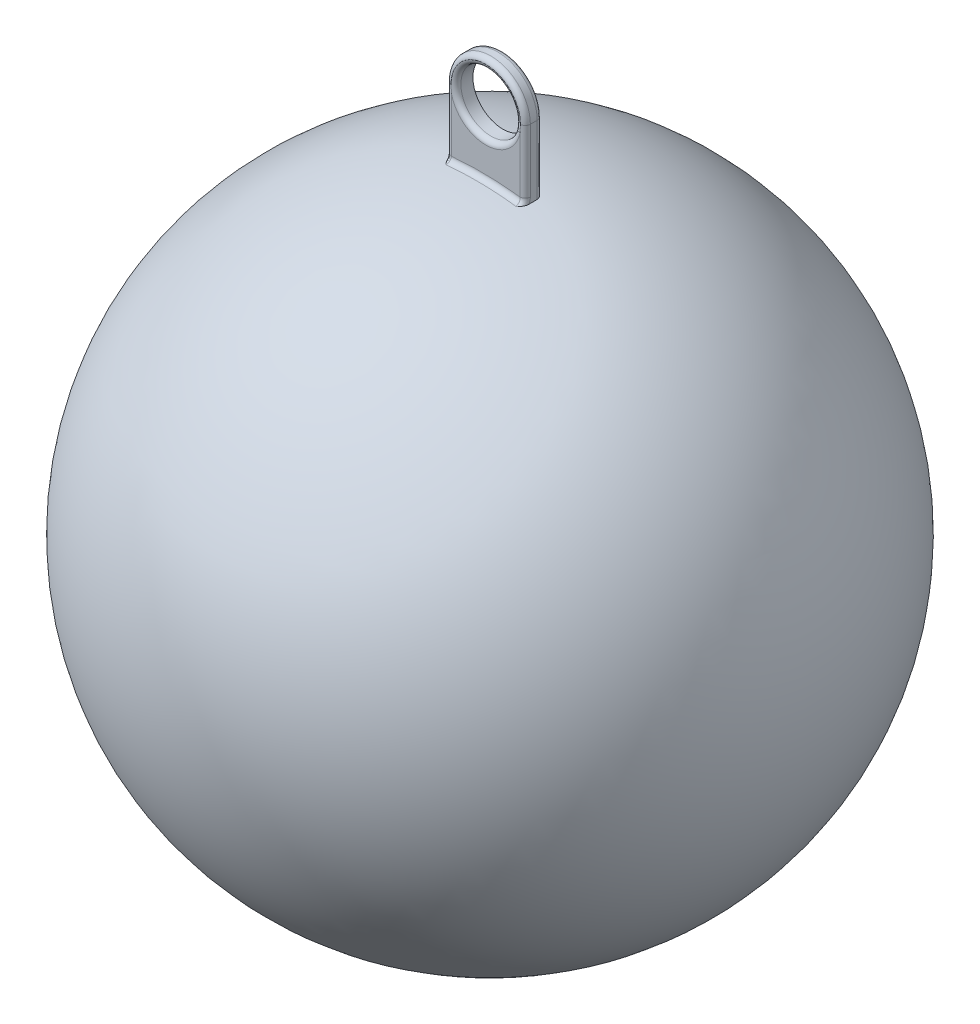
ISO-10303-21;
HEADER;
FILE_DESCRIPTION(('STEP AP214'),'2;1');
FILE_NAME('part.step','',(''),(''),'','','');
FILE_SCHEMA(('AUTOMOTIVE_DESIGN { 1 0 10303 214 1 1 1 1 }'));
ENDSEC;
DATA;
#1=APPLICATION_CONTEXT('core data for automotive mechanical design processes');
#2=APPLICATION_PROTOCOL_DEFINITION('international standard','automotive_design',2000,#1);
#3=PRODUCT_CONTEXT('',#1,'mechanical');
#4=PRODUCT('Part','Part','',(#3));
#5=PRODUCT_RELATED_PRODUCT_CATEGORY('part','',(#4));
#6=PRODUCT_DEFINITION_FORMATION('','',#4);
#7=PRODUCT_DEFINITION_CONTEXT('part definition',#1,'design');
#8=PRODUCT_DEFINITION('design','',#6,#7);
#9=PRODUCT_DEFINITION_SHAPE('','',#8);
#10=(LENGTH_UNIT() NAMED_UNIT(*) SI_UNIT(.MILLI.,.METRE.));
#11=(NAMED_UNIT(*) PLANE_ANGLE_UNIT() SI_UNIT($,.RADIAN.));
#12=(NAMED_UNIT(*) SI_UNIT($,.STERADIAN.) SOLID_ANGLE_UNIT());
#13=UNCERTAINTY_MEASURE_WITH_UNIT(LENGTH_MEASURE(1.E-05),#10,'distance_accuracy_value','');
#14=(GEOMETRIC_REPRESENTATION_CONTEXT(3) GLOBAL_UNCERTAINTY_ASSIGNED_CONTEXT((#13)) GLOBAL_UNIT_ASSIGNED_CONTEXT((#10,
#11,#12)) REPRESENTATION_CONTEXT('',''));
#15=CARTESIAN_POINT('',(0.,0.,0.));
#16=DIRECTION('',(0.,0.,1.));
#17=DIRECTION('',(1.,0.,0.));
#18=AXIS2_PLACEMENT_3D('',#15,#16,#17);
#19=CARTESIAN_POINT('',(-18.395011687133,114.330387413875,0.25));
#20=DIRECTION('',(0.,1.,0.));
#21=DIRECTION('',(0.,0.,1.));
#22=AXIS2_PLACEMENT_3D('',#19,#20,#21);
#23=PLANE('',#22);
#24=CARTESIAN_POINT('',(-17.3734946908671,114.330387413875,0.));
#25=DIRECTION('',(0.,1.,0.));
#26=DIRECTION('',(0.,0.,1.));
#27=AXIS2_PLACEMENT_3D('',#24,#25,#26);
#28=CIRCLE('',#27,1.27848300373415);
#29=CARTESIAN_POINT('',(-16.1039662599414,114.330387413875,-0.151050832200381));
#30=VERTEX_POINT('',#29);
#31=CARTESIAN_POINT('',(-16.095011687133,114.330387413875,0.));
#32=VERTEX_POINT('',#31);
#33=EDGE_CURVE('E93',#30,#32,#28,.F.);
#34=ORIENTED_EDGE('',*,*,#33,.F.);
#35=CARTESIAN_POINT('',(-16.245011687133,114.330387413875,-0.1));
#36=DIRECTION('',(0.,1.,0.));
#37=DIRECTION('',(0.,0.,1.));
#38=AXIS2_PLACEMENT_3D('',#35,#36,#37);
#39=CIRCLE('',#38,0.15);
#40=CARTESIAN_POINT('',(-16.095011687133,114.330387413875,-0.1));
#41=VERTEX_POINT('',#40);
#42=EDGE_CURVE('E162',#30,#41,#39,.F.);
#43=ORIENTED_EDGE('',*,*,#42,.T.);
#44=DIRECTION('',(0.,0.,-1.));
#45=VECTOR('',#44,1.);
#46=CARTESIAN_POINT('',(-16.095011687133,114.330387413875,0.25));
#47=LINE('',#46,#45);
#48=EDGE_CURVE('E164',#32,#41,#47,.T.);
#49=ORIENTED_EDGE('',*,*,#48,.F.);
#50=EDGE_LOOP('',(#34,#43,#49));
#51=FACE_BOUND('',#50,.T.);
#52=ADVANCED_FACE('F46',(#51),#23,.F.);
#53=CARTESIAN_POINT('',(-17.245011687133,116.330387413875,0.25));
#54=DIRECTION('',(0.,0.,1.));
#55=DIRECTION('',(1.,0.,0.));
#56=AXIS2_PLACEMENT_3D('',#53,#54,#55);
#57=PLANE('',#56);
#58=CARTESIAN_POINT('',(-17.3734946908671,105.275195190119,0.25));
#59=DIRECTION('',(0.,0.,1.));
#60=DIRECTION('',(1.,0.,0.));
#61=AXIS2_PLACEMENT_3D('',#58,#59,#60);
#62=CIRCLE('',#61,9.28638923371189);
#63=CARTESIAN_POINT('',(-18.245011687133,114.520598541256,0.25));
#64=VERTEX_POINT('',#63);
#65=CARTESIAN_POINT('',(-16.2450116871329,114.492762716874,0.25));
#66=VERTEX_POINT('',#65);
#67=EDGE_CURVE('E281',#64,#66,#62,.F.);
#68=ORIENTED_EDGE('',*,*,#67,.T.);
#69=DIRECTION('',(0.,1.,0.));
#70=VECTOR('',#69,1.);
#71=CARTESIAN_POINT('',(-16.245011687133,116.330387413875,0.25));
#72=LINE('',#71,#70);
#73=CARTESIAN_POINT('',(-16.245011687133,116.105387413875,0.25));
#74=VERTEX_POINT('',#73);
#75=EDGE_CURVE('E66',#66,#74,#72,.T.);
#76=ORIENTED_EDGE('',*,*,#75,.T.);
#77=CARTESIAN_POINT('',(-17.245011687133,116.330387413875,0.25));
#78=DIRECTION('',(0.,0.,1.));
#79=DIRECTION('',(1.,0.,0.));
#80=AXIS2_PLACEMENT_3D('',#77,#78,#79);
#81=CIRCLE('',#80,1.025);
#82=CARTESIAN_POINT('',(-18.245011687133,116.105387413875,0.25));
#83=VERTEX_POINT('',#82);
#84=EDGE_CURVE('E186',#74,#83,#81,.F.);
#85=ORIENTED_EDGE('',*,*,#84,.T.);
#86=DIRECTION('',(0.,-1.,0.));
#87=VECTOR('',#86,1.);
#88=CARTESIAN_POINT('',(-18.245011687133,114.505229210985,0.25));
#89=LINE('',#88,#87);
#90=EDGE_CURVE('E184',#83,#64,#89,.T.);
#91=ORIENTED_EDGE('',*,*,#90,.T.);
#92=EDGE_LOOP('',(#68,#76,#85,#91));
#93=FACE_BOUND('',#92,.T.);
#94=ADVANCED_FACE('F245',(#93),#57,.T.);
#95=CARTESIAN_POINT('',(-17.245011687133,116.330387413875,-0.25));
#96=DIRECTION('',(0.,0.,1.));
#97=DIRECTION('',(1.,0.,0.));
#98=AXIS2_PLACEMENT_3D('',#95,#96,#97);
#99=PLANE('',#98);
#100=CARTESIAN_POINT('',(-17.245011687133,116.330387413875,-0.25));
#101=DIRECTION('',(0.,0.,1.));
#102=DIRECTION('',(1.,0.,0.));
#103=AXIS2_PLACEMENT_3D('',#100,#101,#102);
#104=CIRCLE('',#103,1.);
#105=CARTESIAN_POINT('',(-18.245011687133,116.330387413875,-0.25));
#106=VERTEX_POINT('',#105);
#107=CARTESIAN_POINT('',(-16.245011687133,116.330387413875,-0.25));
#108=VERTEX_POINT('',#107);
#109=EDGE_CURVE('E176',#106,#108,#104,.F.);
#110=ORIENTED_EDGE('',*,*,#109,.T.);
#111=DIRECTION('',(0.,1.,0.));
#112=VECTOR('',#111,1.);
#113=CARTESIAN_POINT('',(-16.245011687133,116.330387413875,-0.25));
#114=LINE('',#113,#112);
#115=CARTESIAN_POINT('',(-16.245011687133,114.346857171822,-0.25));
#116=VERTEX_POINT('',#115);
#117=EDGE_CURVE('E172',#108,#116,#114,.F.);
#118=ORIENTED_EDGE('',*,*,#117,.T.);
#119=CARTESIAN_POINT('',(-17.3734946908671,105.275195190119,-0.25));
#120=DIRECTION('',(0.,0.,1.));
#121=DIRECTION('',(1.,0.,0.));
#122=AXIS2_PLACEMENT_3D('',#119,#120,#121);
#123=CIRCLE('',#122,9.14158219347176);
#124=CARTESIAN_POINT('',(-18.245011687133,114.375139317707,-0.25));
#125=VERTEX_POINT('',#124);
#126=EDGE_CURVE('E154',#125,#116,#123,.F.);
#127=ORIENTED_EDGE('',*,*,#126,.F.);
#128=DIRECTION('',(0.,-1.,0.));
#129=VECTOR('',#128,1.);
#130=CARTESIAN_POINT('',(-18.245011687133,116.330387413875,-0.25));
#131=LINE('',#130,#129);
#132=EDGE_CURVE('E422',#125,#106,#131,.F.);
#133=ORIENTED_EDGE('',*,*,#132,.T.);
#134=EDGE_LOOP('',(#110,#118,#127,#133));
#135=FACE_BOUND('',#134,.T.);
#136=CARTESIAN_POINT('',(-17.245011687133,116.330387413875,-0.25));
#137=DIRECTION('',(0.,0.,1.));
#138=DIRECTION('',(1.,0.,0.));
#139=AXIS2_PLACEMENT_3D('',#136,#137,#138);
#140=CIRCLE('',#139,0.875000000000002);
#141=CARTESIAN_POINT('',(-16.370011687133,116.330387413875,-0.25));
#142=VERTEX_POINT('',#141);
#143=EDGE_CURVE('E387',#142,#142,#140,.T.);
#144=ORIENTED_EDGE('',*,*,#143,.T.);
#145=EDGE_LOOP('',(#144));
#146=FACE_BOUND('',#145,.T.);
#147=ADVANCED_FACE('F251',(#135,#146),#99,.F.);
#148=CARTESIAN_POINT('',(-17.245011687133,116.330387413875,0.25));
#149=DIRECTION('',(0.,0.,-1.));
#150=DIRECTION('',(-1.,0.,0.));
#151=AXIS2_PLACEMENT_3D('',#148,#149,#150);
#152=CYLINDRICAL_SURFACE('',#151,1.15);
#153=DIRECTION('',(0.,0.,-1.));
#154=VECTOR('',#153,1.);
#155=CARTESIAN_POINT('',(-16.095011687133,116.330387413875,0.25));
#156=LINE('',#155,#154);
#157=CARTESIAN_POINT('',(-16.095011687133,116.330387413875,0.1));
#158=VERTEX_POINT('',#157);
#159=CARTESIAN_POINT('',(-16.095011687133,116.330387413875,-0.1));
#160=VERTEX_POINT('',#159);
#161=EDGE_CURVE('E273',#158,#160,#156,.T.);
#162=ORIENTED_EDGE('',*,*,#161,.T.);
#163=CARTESIAN_POINT('',(-17.245011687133,116.330387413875,-0.1));
#164=DIRECTION('',(0.,0.,1.));
#165=DIRECTION('',(1.,0.,0.));
#166=AXIS2_PLACEMENT_3D('',#163,#164,#165);
#167=CIRCLE('',#166,1.15);
#168=CARTESIAN_POINT('',(-18.395011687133,116.330387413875,-0.1));
#169=VERTEX_POINT('',#168);
#170=EDGE_CURVE('E174',#160,#169,#167,.T.);
#171=ORIENTED_EDGE('',*,*,#170,.T.);
#172=DIRECTION('',(0.,0.,-1.));
#173=VECTOR('',#172,1.);
#174=CARTESIAN_POINT('',(-18.395011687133,116.330387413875,0.25));
#175=LINE('',#174,#173);
#176=CARTESIAN_POINT('',(-18.395011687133,116.330387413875,0.1));
#177=VERTEX_POINT('',#176);
#178=EDGE_CURVE('E269',#177,#169,#175,.T.);
#179=ORIENTED_EDGE('',*,*,#178,.F.);
#180=CARTESIAN_POINT('',(-17.245011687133,116.330387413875,0.1));
#181=DIRECTION('',(0.,0.,1.));
#182=DIRECTION('',(1.,0.,0.));
#183=AXIS2_PLACEMENT_3D('',#180,#181,#182);
#184=CIRCLE('',#183,1.15);
#185=EDGE_CURVE('E171',#177,#158,#184,.F.);
#186=ORIENTED_EDGE('',*,*,#185,.T.);
#187=EDGE_LOOP('',(#162,#171,#179,#186));
#188=FACE_BOUND('',#187,.T.);
#189=ADVANCED_FACE('F214',(#188),#152,.T.);
#190=CARTESIAN_POINT('',(-18.395011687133,116.330387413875,0.25));
#191=DIRECTION('',(1.,0.,0.));
#192=DIRECTION('',(0.,0.,-1.));
#193=AXIS2_PLACEMENT_3D('',#190,#191,#192);
#194=PLANE('',#193);
#195=CARTESIAN_POINT('',(-18.395011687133,105.275195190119,0.));
#196=DIRECTION('',(1.,0.,0.));
#197=DIRECTION('',(0.,0.,-1.));
#198=AXIS2_PLACEMENT_3D('',#195,#196,#197);
#199=CIRCLE('',#198,9.08776804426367);
#200=CARTESIAN_POINT('',(-18.395011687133,114.36180594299,0.145027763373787));
#201=VERTEX_POINT('',#200);
#202=CARTESIAN_POINT('',(-18.395011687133,114.362413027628,-0.1));
#203=VERTEX_POINT('',#202);
#204=EDGE_CURVE('E278',#201,#203,#199,.F.);
#205=ORIENTED_EDGE('',*,*,#204,.F.);
#206=CARTESIAN_POINT('',(-18.395011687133,114.583752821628,0.106663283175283));
#207=CARTESIAN_POINT('',(-18.395011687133,114.551827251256,0.256254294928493));
#208=CARTESIAN_POINT('',(-18.2420810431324,114.552451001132,0.253331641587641));
#209=CARTESIAN_POINT('',(-18.395011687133,114.563055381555,0.102174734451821));
#210=CARTESIAN_POINT('',(-18.395011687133,114.541868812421,0.253091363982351));
#211=CARTESIAN_POINT('',(-18.2430343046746,114.542013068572,0.251087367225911));
#212=CARTESIAN_POINT('',(-18.395011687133,114.541840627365,0.0999714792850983));
#213=CARTESIAN_POINT('',(-18.395011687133,114.53136283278,0.250979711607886));
#214=CARTESIAN_POINT('',(-18.244019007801,114.531313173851,0.249985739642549));
#215=CARTESIAN_POINT('',(-18.395011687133,114.486636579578,0.100045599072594));
#216=CARTESIAN_POINT('',(-18.395011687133,114.503535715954,0.248447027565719));
#217=CARTESIAN_POINT('',(-18.2465987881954,114.503467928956,0.250022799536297));
#218=CARTESIAN_POINT('',(-18.395011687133,114.452604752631,0.105796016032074));
#219=CARTESIAN_POINT('',(-18.395011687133,114.48582375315,0.249738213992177));
#220=CARTESIAN_POINT('',(-18.2482062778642,114.486299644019,0.252898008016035));
#221=CARTESIAN_POINT('',(-18.395011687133,114.388404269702,0.128269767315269));
#222=CARTESIAN_POINT('',(-18.395011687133,114.451522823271,0.258606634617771));
#223=CARTESIAN_POINT('',(-18.2512703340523,114.453907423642,0.264134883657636));
#224=CARTESIAN_POINT('',(-18.395011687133,114.358235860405,0.144993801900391));
#225=CARTESIAN_POINT('',(-18.395011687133,114.434903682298,0.266127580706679));
#226=CARTESIAN_POINT('',(-18.2527268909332,114.43868361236,0.272496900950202));
#227=CARTESIAN_POINT('',(-18.395011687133,114.305206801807,0.187476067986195));
#228=CARTESIAN_POINT('',(-18.395011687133,114.405221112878,0.286784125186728));
#229=CARTESIAN_POINT('',(-18.2553072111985,114.411920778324,0.293738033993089));
#230=CARTESIAN_POINT('',(-18.395011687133,114.282332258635,0.213216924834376));
#231=CARTESIAN_POINT('',(-18.395011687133,114.392090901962,0.299885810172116));
#232=CARTESIAN_POINT('',(-18.2564316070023,114.400374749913,0.30660846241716));
#233=CARTESIAN_POINT('',(-18.395011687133,114.246539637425,0.270713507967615));
#234=CARTESIAN_POINT('',(-18.395011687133,114.371406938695,0.330017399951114));
#235=CARTESIAN_POINT('',(-18.2581989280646,114.382307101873,0.335356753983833));
#236=CARTESIAN_POINT('',(-18.395011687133,114.233578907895,0.302442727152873));
#237=CARTESIAN_POINT('',(-18.395011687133,114.363769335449,0.34705263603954));
#238=CARTESIAN_POINT('',(-18.2588439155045,114.375763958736,0.351221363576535));
#239=CARTESIAN_POINT('',(-18.395011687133,114.219016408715,0.368333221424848));
#240=CARTESIAN_POINT('',(-18.395011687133,114.355208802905,0.382710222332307));
#241=CARTESIAN_POINT('',(-18.2595689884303,114.368412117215,0.384166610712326));
#242=CARTESIAN_POINT('',(-18.395011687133,114.217367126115,0.402483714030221));
#243=CARTESIAN_POINT('',(-18.395011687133,114.35422860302,0.401382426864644));
#244=CARTESIAN_POINT('',(-18.259651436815,114.367579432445,0.401241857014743));
#245=CARTESIAN_POINT('',(-18.395011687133,114.22338875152,0.45250496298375));
#246=CARTESIAN_POINT('',(-18.395011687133,114.357772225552,0.428550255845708));
#247=CARTESIAN_POINT('',(-18.2593513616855,114.370619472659,0.426252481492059));
#248=CARTESIAN_POINT('',(-18.395011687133,114.226816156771,0.468986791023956));
#249=CARTESIAN_POINT('',(-18.395011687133,114.359794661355,0.437486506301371));
#250=CARTESIAN_POINT('',(-18.2591804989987,114.372349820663,0.434493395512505));
#251=CARTESIAN_POINT('',(-18.395011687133,114.236378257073,0.501158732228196));
#252=CARTESIAN_POINT('',(-18.395011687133,114.365403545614,0.454828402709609));
#253=CARTESIAN_POINT('',(-18.2587049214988,114.377177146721,0.450579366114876));
#254=CARTESIAN_POINT('',(-18.395011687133,114.242514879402,0.516848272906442));
#255=CARTESIAN_POINT('',(-18.395011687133,114.368995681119,0.463239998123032));
#256=CARTESIAN_POINT('',(-18.2584001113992,114.380275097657,0.458424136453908));
#257=CARTESIAN_POINT('',(-18.395011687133,114.249938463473,0.531937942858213));
#258=CARTESIAN_POINT('',(-18.395011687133,114.373313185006,0.471237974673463));
#259=CARTESIAN_POINT('',(-18.2580322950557,114.38402261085,0.465968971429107));
#260=(BOUNDED_SURFACE() B_SPLINE_SURFACE(3,2,((#206,#207,#208),(#209,#210,#211),(#212,#213,
#214),(#215,#216,#217),(#218,#219,#220),(#221,#222,#223),(#224,#225,#226),(#227,#228,#229),
(#230,#231,#232),(#233,#234,#235),(#236,#237,#238),(#239,#240,#241),(#242,#243,#244),(#245,#246,
#247),(#248,#249,#250),(#251,#252,#253),(#254,#255,#256),(#257,#258,#259)),.UNSPECIFIED.,.F.,
.F.,.F.) B_SPLINE_SURFACE_WITH_KNOTS((4,2,2,2,2,2,2,2,4),(3,3),(0.,0.0635048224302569,
0.165036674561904,0.266575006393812,0.367918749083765,0.468823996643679,0.569305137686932,
0.61960165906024,0.669934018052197),(0.,1.),
.UNSPECIFIED.) GEOMETRIC_REPRESENTATION_ITEM() RATIONAL_B_SPLINE_SURFACE(((1.,0.7001651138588,
1.),(1.,0.702435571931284,1.),(1.,0.70476753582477,1.),(1.,0.710846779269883,1.),(1.,
0.714605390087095,1.),(1.,0.721716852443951,1.),(1.,0.725069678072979,1.),(1.,0.730976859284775,
1.),(1.,0.733532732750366,1.),(1.,0.737537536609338,1.),(1.,0.738991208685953,1.),(1.,
0.740624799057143,1.),(1.,0.740810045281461,1.),(1.,0.740134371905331,1.),(1.,0.739749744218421,
1.),(1.,0.738677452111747,1.),(1.,0.737989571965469,1.),(1.,0.737158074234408,1.))) REPRESENTATION_ITEM('') SURFACE());
#261=CARTESIAN_POINT('',(-18.395011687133,114.249938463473,0.531937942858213));
#262=CARTESIAN_POINT('',(-18.395011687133,114.242514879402,0.516848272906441));
#263=CARTESIAN_POINT('',(-18.395011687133,114.236378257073,0.501158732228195));
#264=CARTESIAN_POINT('',(-18.395011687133,114.226816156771,0.468986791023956));
#265=CARTESIAN_POINT('',(-18.395011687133,114.22338875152,0.45250496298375));
#266=CARTESIAN_POINT('',(-18.395011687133,114.217367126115,0.40248371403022));
#267=CARTESIAN_POINT('',(-18.395011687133,114.219016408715,0.368333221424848));
#268=CARTESIAN_POINT('',(-18.395011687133,114.233578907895,0.302442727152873));
#269=CARTESIAN_POINT('',(-18.395011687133,114.246539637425,0.270713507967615));
#270=CARTESIAN_POINT('',(-18.395011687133,114.282332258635,0.213216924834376));
#271=CARTESIAN_POINT('',(-18.395011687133,114.305206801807,0.187476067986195));
#272=CARTESIAN_POINT('',(-18.395011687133,114.358235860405,0.144993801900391));
#273=CARTESIAN_POINT('',(-18.395011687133,114.388404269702,0.128269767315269));
#274=CARTESIAN_POINT('',(-18.395011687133,114.452604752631,0.105796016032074));
#275=CARTESIAN_POINT('',(-18.395011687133,114.486636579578,0.100045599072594));
#276=CARTESIAN_POINT('',(-18.395011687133,114.541840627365,0.0999714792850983));
#277=CARTESIAN_POINT('',(-18.395011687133,114.563055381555,0.102174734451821));
#278=CARTESIAN_POINT('',(-18.395011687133,114.583752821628,0.106663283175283));
#279=B_SPLINE_CURVE_WITH_KNOTS('',3,(#261,#262,#263,#264,#265,#266,#267,#268,#269,#270,#271,
#272,#273,#274,#275,#276,#277,#278),.UNSPECIFIED.,.F.,.F.,(4,2,2,2,2,2,2,2,4),(0.,
0.0503323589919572,0.100628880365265,0.201110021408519,0.302015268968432,0.403359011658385,
0.504897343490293,0.60642919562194,0.669934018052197),.UNSPECIFIED.);
#280=CARTESIAN_POINT('',(-18.395011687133,114.520598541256,0.1));
#281=VERTEX_POINT('',#280);
#282=EDGE_CURVE('E416',#201,#281,#279,.T.);
#283=ORIENTED_EDGE('',*,*,#282,.T.);
#284=DIRECTION('',(0.,-1.,0.));
#285=VECTOR('',#284,1.);
#286=CARTESIAN_POINT('',(-18.395011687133,116.330387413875,0.1));
#287=LINE('',#286,#285);
#288=EDGE_CURVE('E384',#281,#177,#287,.F.);
#289=ORIENTED_EDGE('',*,*,#288,.T.);
#290=ORIENTED_EDGE('',*,*,#178,.T.);
#291=DIRECTION('',(0.,-1.,0.));
#292=VECTOR('',#291,1.);
#293=CARTESIAN_POINT('',(-18.395011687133,116.330387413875,-0.1));
#294=LINE('',#293,#292);
#295=EDGE_CURVE('E413',#169,#203,#294,.T.);
#296=ORIENTED_EDGE('',*,*,#295,.T.);
#297=EDGE_LOOP('',(#205,#283,#289,#290,#296));
#298=FACE_BOUND('',#297,.T.);
#299=ADVANCED_FACE('F256',(#298),#194,.F.);
#300=CARTESIAN_POINT('',(-16.095011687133,114.330387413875,0.146957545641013));
#301=VERTEX_POINT('',#300);
#302=EDGE_CURVE('E266',#301,#32,#47,.T.);
#303=ORIENTED_EDGE('',*,*,#302,.F.);
#304=CARTESIAN_POINT('',(-16.2488129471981,114.524953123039,0.253343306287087));
#305=CARTESIAN_POINT('',(-16.095011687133,114.524140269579,0.257156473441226));
#306=CARTESIAN_POINT('',(-16.095011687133,114.556215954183,0.106686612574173));
#307=CARTESIAN_POINT('',(-16.2475764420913,114.514404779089,0.251091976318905));
#308=CARTESIAN_POINT('',(-16.095011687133,114.514218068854,0.25369935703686));
#309=CARTESIAN_POINT('',(-16.095011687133,114.53541983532,0.102183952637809));
#310=CARTESIAN_POINT('',(-16.2462992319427,114.503591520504,0.249986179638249));
#311=CARTESIAN_POINT('',(-16.095011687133,114.503656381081,0.251276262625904));
#312=CARTESIAN_POINT('',(-16.095011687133,114.51410501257,0.0999723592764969));
#313=CARTESIAN_POINT('',(-16.2429517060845,114.475437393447,0.250022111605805));
#314=CARTESIAN_POINT('',(-16.095011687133,114.475526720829,0.24798069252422));
#315=CARTESIAN_POINT('',(-16.095011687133,114.458616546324,0.100044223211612));
#316=CARTESIAN_POINT('',(-16.2408652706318,114.458072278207,0.252910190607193));
#317=CARTESIAN_POINT('',(-16.095011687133,114.457458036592,0.248832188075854));
#318=CARTESIAN_POINT('',(-16.095011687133,114.42440005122,0.105820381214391));
#319=CARTESIAN_POINT('',(-16.2368880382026,114.425303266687,0.264206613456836));
#320=CARTESIAN_POINT('',(-16.095011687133,114.422246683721,0.257116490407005));
#321=CARTESIAN_POINT('',(-16.095011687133,114.359846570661,0.128413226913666));
#322=CARTESIAN_POINT('',(-16.2349972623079,114.409899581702,0.272615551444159));
#323=CARTESIAN_POINT('',(-16.095011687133,114.405066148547,0.264473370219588));
#324=CARTESIAN_POINT('',(-16.095011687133,114.329510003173,0.1452311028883));
#325=CARTESIAN_POINT('',(-16.2316511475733,114.382846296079,0.293961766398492));
#326=CARTESIAN_POINT('',(-16.095011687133,114.374321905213,0.285124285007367));
#327=CARTESIAN_POINT('',(-16.095011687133,114.276239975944,0.187923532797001));
#328=CARTESIAN_POINT('',(-16.2301944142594,114.37118466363,0.306884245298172));
#329=CARTESIAN_POINT('',(-16.095011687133,114.360668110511,0.298366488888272));
#330=CARTESIAN_POINT('',(-16.095011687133,114.253282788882,0.213768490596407));
#331=CARTESIAN_POINT('',(-16.2279124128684,114.352995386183,0.335760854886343));
#332=CARTESIAN_POINT('',(-16.095011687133,114.339217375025,0.329042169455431));
#333=CARTESIAN_POINT('',(-16.095011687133,114.217479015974,0.271521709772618));
#334=CARTESIAN_POINT('',(-16.2270826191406,114.346430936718,0.35169219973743));
#335=CARTESIAN_POINT('',(-16.095011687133,114.331299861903,0.346472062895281));
#336=CARTESIAN_POINT('',(-16.095011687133,114.204559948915,0.303384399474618));
#337=CARTESIAN_POINT('',(-16.2263864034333,114.340927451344,0.376389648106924));
#338=CARTESIAN_POINT('',(-16.095011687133,114.324671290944,0.373763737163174));
#339=CARTESIAN_POINT('',(-16.095011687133,114.193729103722,0.352779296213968));
#340=CARTESIAN_POINT('',(-16.2262454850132,114.339814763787,0.384738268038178));
#341=CARTESIAN_POINT('',(-16.095011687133,114.323328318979,0.383036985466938));
#342=CARTESIAN_POINT('',(-16.095011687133,114.191539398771,0.369476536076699));
#343=CARTESIAN_POINT('',(-16.226145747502,114.339027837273,0.401508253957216));
#344=CARTESIAN_POINT('',(-16.095011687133,114.322376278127,0.401673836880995));
#345=CARTESIAN_POINT('',(-16.095011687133,114.189990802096,0.40301650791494));
#346=CARTESIAN_POINT('',(-16.2261870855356,114.339354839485,0.409929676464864));
#347=CARTESIAN_POINT('',(-16.095011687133,114.322767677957,0.411047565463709));
#348=CARTESIAN_POINT('',(-16.095011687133,114.190634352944,0.419859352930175));
#349=CARTESIAN_POINT('',(-16.226320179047,114.340404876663,0.418278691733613));
#350=CARTESIAN_POINT('',(-16.095011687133,114.324038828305,0.420304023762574));
#351=CARTESIAN_POINT('',(-16.095011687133,114.192700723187,0.436557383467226));
#352=(BOUNDED_SURFACE() B_SPLINE_SURFACE(3,2,((#304,#305,#306),(#307,#308,#309),(#310,#311,
#312),(#313,#314,#315),(#316,#317,#318),(#319,#320,#321),(#322,#323,#324),(#325,#326,#327),
(#328,#329,#330),(#331,#332,#333),(#334,#335,#336),(#337,#338,#339),(#340,#341,#342),(#343,#344,
#345),(#346,#347,#348),(#349,#350,#351)),.UNSPECIFIED.,.F.,.F.,
.F.) B_SPLINE_SURFACE_WITH_KNOTS((4,2,2,2,2,2,2,4),(3,3),(0.,0.0638045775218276,
0.165887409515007,0.267981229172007,0.369743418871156,0.470763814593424,0.521075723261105,
0.571431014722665),(0.,1.),
.UNSPECIFIED.) GEOMETRIC_REPRESENTATION_ITEM() RATIONAL_B_SPLINE_SURFACE(((1.,0.69808963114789,
1.),(1.,0.70104396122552,1.),(1.,0.704072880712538,1.),(1.,0.711960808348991,1.),(1.,
0.716827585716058,1.),(1.,0.726016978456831,1.),(1.,0.730339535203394,1.),(1.,0.737936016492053,
1.),(1.,0.741213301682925,1.),(1.,0.746327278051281,1.),(1.,0.748174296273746,1.),(1.,
0.749722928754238,1.),(1.,0.750036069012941,1.),(1.,0.750257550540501,1.),(1.,0.750165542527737,
1.),(1.,0.74987000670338,1.))) REPRESENTATION_ITEM('') SURFACE());
#353=CARTESIAN_POINT('',(-16.095011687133,114.330387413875,0.146957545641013));
#354=CARTESIAN_POINT('',(-16.0949993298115,114.330387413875,0.159807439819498));
#355=CARTESIAN_POINT('',(-16.0961862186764,114.330387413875,0.172601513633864));
#356=CARTESIAN_POINT('',(-16.1005285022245,114.330387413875,0.19767029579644));
#357=CARTESIAN_POINT('',(-16.1036552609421,114.330387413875,0.209949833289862));
#358=CARTESIAN_POINT('',(-16.1094435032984,114.330387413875,0.227737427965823));
#359=CARTESIAN_POINT('',(-16.1115052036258,114.330387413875,0.233454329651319));
#360=CARTESIAN_POINT('',(-16.1159641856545,114.330387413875,0.244802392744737));
#361=CARTESIAN_POINT('',(-16.1183637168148,114.330387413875,0.250432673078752));
#362=CARTESIAN_POINT('',(-16.1209042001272,114.330387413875,0.25599971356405));
#363=B_SPLINE_CURVE_WITH_KNOTS('',3,(#353,#354,#355,#356,#357,#358,#359,#360,#361,#362),
.UNSPECIFIED.,.F.,.F.,(4,2,2,2,4),(0.,0.0384167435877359,0.0762794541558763,0.094504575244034,
0.112857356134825),.UNSPECIFIED.);
#364=CARTESIAN_POINT('',(-16.1209042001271,114.330387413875,0.255999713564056));
#365=VERTEX_POINT('',#364);
#366=EDGE_CURVE('E267',#301,#365,#363,.T.);
#367=ORIENTED_EDGE('',*,*,#366,.T.);
#368=EDGE_CURVE('E165',#32,#365,#28,.F.);
#369=ORIENTED_EDGE('',*,*,#368,.F.);
#370=EDGE_LOOP('',(#303,#367,#369));
#371=FACE_BOUND('',#370,.T.);
#372=ADVANCED_FACE('F247',(#371),#23,.F.);
#373=CARTESIAN_POINT('',(-16.095011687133,114.330387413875,0.25));
#374=DIRECTION('',(-1.,0.,0.));
#375=DIRECTION('',(0.,-1.,0.));
#376=AXIS2_PLACEMENT_3D('',#373,#374,#375);
#377=PLANE('',#376);
#378=ORIENTED_EDGE('',*,*,#48,.T.);
#379=DIRECTION('',(0.,1.,0.));
#380=VECTOR('',#379,1.);
#381=CARTESIAN_POINT('',(-16.095011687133,114.330387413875,-0.1));
#382=LINE('',#381,#380);
#383=EDGE_CURVE('E170',#41,#160,#382,.T.);
#384=ORIENTED_EDGE('',*,*,#383,.T.);
#385=ORIENTED_EDGE('',*,*,#161,.F.);
#386=DIRECTION('',(0.,1.,0.));
#387=VECTOR('',#386,1.);
#388=CARTESIAN_POINT('',(-16.095011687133,114.47315725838,0.1));
#389=LINE('',#388,#387);
#390=CARTESIAN_POINT('',(-16.095011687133,114.492762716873,0.1));
#391=VERTEX_POINT('',#390);
#392=EDGE_CURVE('E286',#158,#391,#389,.F.);
#393=ORIENTED_EDGE('',*,*,#392,.T.);
#394=CARTESIAN_POINT('',(-16.095011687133,114.556215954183,0.106686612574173));
#395=CARTESIAN_POINT('',(-16.095011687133,114.53541983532,0.102183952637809));
#396=CARTESIAN_POINT('',(-16.095011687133,114.51410501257,0.0999723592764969));
#397=CARTESIAN_POINT('',(-16.095011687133,114.458616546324,0.100044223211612));
#398=CARTESIAN_POINT('',(-16.095011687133,114.42440005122,0.105820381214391));
#399=CARTESIAN_POINT('',(-16.095011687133,114.359846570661,0.128413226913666));
#400=CARTESIAN_POINT('',(-16.095011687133,114.329510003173,0.1452311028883));
#401=CARTESIAN_POINT('',(-16.095011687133,114.276239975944,0.187923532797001));
#402=CARTESIAN_POINT('',(-16.095011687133,114.253282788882,0.213768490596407));
#403=CARTESIAN_POINT('',(-16.095011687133,114.217479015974,0.271521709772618));
#404=CARTESIAN_POINT('',(-16.095011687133,114.204559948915,0.303384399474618));
#405=CARTESIAN_POINT('',(-16.095011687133,114.193729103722,0.352779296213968));
#406=CARTESIAN_POINT('',(-16.095011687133,114.191539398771,0.369476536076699));
#407=CARTESIAN_POINT('',(-16.095011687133,114.189990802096,0.40301650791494));
#408=CARTESIAN_POINT('',(-16.095011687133,114.190634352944,0.419859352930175));
#409=CARTESIAN_POINT('',(-16.095011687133,114.192700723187,0.436557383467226));
#410=B_SPLINE_CURVE_WITH_KNOTS('',3,(#394,#395,#396,#397,#398,#399,#400,#401,#402,#403,#404,
#405,#406,#407,#408,#409),.UNSPECIFIED.,.F.,.F.,(4,2,2,2,2,2,2,4),(0.,0.0638045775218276,
0.165887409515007,0.267981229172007,0.369743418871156,0.470763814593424,0.521075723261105,
0.571431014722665),.UNSPECIFIED.);
#411=EDGE_CURVE('E288',#391,#301,#410,.T.);
#412=ORIENTED_EDGE('',*,*,#411,.T.);
#413=ORIENTED_EDGE('',*,*,#302,.T.);
#414=EDGE_LOOP('',(#378,#384,#385,#393,#412,#413));
#415=FACE_BOUND('',#414,.T.);
#416=ADVANCED_FACE('F255',(#415),#377,.F.);
#417=CARTESIAN_POINT('',(-17.245011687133,116.330387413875,0.25));
#418=DIRECTION('',(0.,0.,-1.));
#419=DIRECTION('',(-1.,0.,0.));
#420=AXIS2_PLACEMENT_3D('',#417,#418,#419);
#421=CYLINDRICAL_SURFACE('',#420,0.875000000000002);
#422=CARTESIAN_POINT('',(-17.245011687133,116.330387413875,0.1));
#423=DIRECTION('',(0.,0.,1.));
#424=DIRECTION('',(1.,0.,0.));
#425=AXIS2_PLACEMENT_3D('',#422,#423,#424);
#426=CIRCLE('',#425,0.875000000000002);
#427=CARTESIAN_POINT('',(-16.370011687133,116.330387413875,0.1));
#428=VERTEX_POINT('',#427);
#429=EDGE_CURVE('E181',#428,#428,#426,.T.);
#430=ORIENTED_EDGE('',*,*,#429,.T.);
#431=EDGE_LOOP('',(#430));
#432=FACE_BOUND('',#431,.T.);
#433=ORIENTED_EDGE('',*,*,#143,.F.);
#434=EDGE_LOOP('',(#433));
#435=FACE_BOUND('',#434,.T.);
#436=ADVANCED_FACE('F213',(#432,#435),#421,.F.);
#437=CARTESIAN_POINT('',(-17.3734946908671,105.275195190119,0.));
#438=DIRECTION('',(0.,1.,0.));
#439=DIRECTION('',(1.,0.,0.));
#440=AXIS2_PLACEMENT_3D('',#437,#438,#439);
#441=SPHERICAL_SURFACE('',#440,9.145);
#442=ORIENTED_EDGE('',*,*,#368,.T.);
#443=CARTESIAN_POINT('',(-16.1209042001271,114.330387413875,0.255999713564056));
#444=CARTESIAN_POINT('',(-16.1388868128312,114.331798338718,0.293921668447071));
#445=CARTESIAN_POINT('',(-16.1636734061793,114.334021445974,0.326666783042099));
#446=CARTESIAN_POINT('',(-16.2019349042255,114.337347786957,0.368945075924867));
#447=CARTESIAN_POINT('',(-16.2131054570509,114.338308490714,0.380469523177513));
#448=CARTESIAN_POINT('',(-16.2250291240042,114.339305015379,0.392384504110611));
#449=CARTESIAN_POINT('',(-16.2256109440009,114.339353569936,0.392964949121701));
#450=CARTESIAN_POINT('',(-16.2261931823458,114.339402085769,0.393544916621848));
#451=B_SPLINE_CURVE_WITH_KNOTS('',3,(#443,#444,#445,#446,#447,#448,#449,#450),.UNSPECIFIED.,.F.,
.F.,(4,2,2,4),(0.,0.123241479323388,0.171426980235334,0.173896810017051),.UNSPECIFIED.);
#452=CARTESIAN_POINT('',(-16.2261931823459,114.339402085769,0.39354491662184));
#453=VERTEX_POINT('',#452);
#454=EDGE_CURVE('E189',#365,#453,#451,.T.);
#455=ORIENTED_EDGE('',*,*,#454,.T.);
#456=CARTESIAN_POINT('',(-17.3734946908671,105.275195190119,0.39354491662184));
#457=DIRECTION('',(0.,0.,-1.));
#458=DIRECTION('',(-1.,0.,0.));
#459=AXIS2_PLACEMENT_3D('',#456,#457,#458);
#460=CIRCLE('',#459,9.13652819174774);
#461=CARTESIAN_POINT('',(-18.2595450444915,114.368657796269,0.39354491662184));
#462=VERTEX_POINT('',#461);
#463=EDGE_CURVE('E283',#453,#462,#460,.F.);
#464=ORIENTED_EDGE('',*,*,#463,.T.);
#465=CARTESIAN_POINT('',(-18.395011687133,114.36180594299,0.145027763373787));
#466=CARTESIAN_POINT('',(-18.3950199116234,114.361600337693,0.15785937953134));
#467=CARTESIAN_POINT('',(-18.3938464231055,114.361501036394,0.170639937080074));
#468=CARTESIAN_POINT('',(-18.3894706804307,114.361485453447,0.195720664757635));
#469=CARTESIAN_POINT('',(-18.3862894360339,114.361567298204,0.208024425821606));
#470=CARTESIAN_POINT('',(-18.3766799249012,114.361941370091,0.236632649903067));
#471=CARTESIAN_POINT('',(-18.3694757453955,114.362301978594,0.252671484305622));
#472=CARTESIAN_POINT('',(-18.3526054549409,114.363227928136,0.283439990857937));
#473=CARTESIAN_POINT('',(-18.3429278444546,114.363794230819,0.29816310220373));
#474=CARTESIAN_POINT('',(-18.3111617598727,114.365681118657,0.340791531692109));
#475=CARTESIAN_POINT('',(-18.286527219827,114.367179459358,0.366722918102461));
#476=CARTESIAN_POINT('',(-18.2607129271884,114.368594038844,0.39238612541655));
#477=CARTESIAN_POINT('',(-18.2601291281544,114.368625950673,0.392965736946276));
#478=CARTESIAN_POINT('',(-18.2595450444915,114.368657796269,0.393544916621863));
#479=B_SPLINE_CURVE_WITH_KNOTS('',3,(#465,#466,#467,#468,#469,#470,#471,#472,#473,#474,#475,
#476,#477,#478),.UNSPECIFIED.,.F.,.F.,(4,2,2,2,2,2,4),(0.,0.0383665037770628,0.0763380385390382,
0.128804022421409,0.181518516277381,0.288318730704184,0.290788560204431),.UNSPECIFIED.);
#480=EDGE_CURVE('E158',#462,#201,#479,.F.);
#481=ORIENTED_EDGE('',*,*,#480,.T.);
#482=ORIENTED_EDGE('',*,*,#204,.T.);
#483=CARTESIAN_POINT('',(-18.395011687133,114.362413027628,-0.1));
#484=CARTESIAN_POINT('',(-18.395018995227,114.3623198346,-0.108404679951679));
#485=CARTESIAN_POINT('',(-18.3943057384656,114.362295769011,-0.116807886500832));
#486=CARTESIAN_POINT('',(-18.3914914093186,114.362383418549,-0.133370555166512));
#487=CARTESIAN_POINT('',(-18.3893915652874,114.36249501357,-0.141530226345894));
#488=CARTESIAN_POINT('',(-18.38385593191,114.362851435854,-0.157384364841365));
#489=CARTESIAN_POINT('',(-18.3804195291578,114.363096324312,-0.16507861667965));
#490=CARTESIAN_POINT('',(-18.3723129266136,114.363711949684,-0.179779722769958));
#491=CARTESIAN_POINT('',(-18.3676429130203,114.364082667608,-0.186786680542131));
#492=CARTESIAN_POINT('',(-18.3571950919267,114.364939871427,-0.199927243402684));
#493=CARTESIAN_POINT('',(-18.3514157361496,114.365426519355,-0.206059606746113));
#494=CARTESIAN_POINT('',(-18.3389175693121,114.366501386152,-0.217269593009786));
#495=CARTESIAN_POINT('',(-18.3321985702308,114.367089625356,-0.222347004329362));
#496=CARTESIAN_POINT('',(-18.3179837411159,114.368353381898,-0.231324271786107));
#497=CARTESIAN_POINT('',(-18.3104847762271,114.369029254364,-0.235219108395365));
#498=CARTESIAN_POINT('',(-18.2949468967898,114.370447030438,-0.241694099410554));
#499=CARTESIAN_POINT('',(-18.2869082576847,114.371188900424,-0.244274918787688));
#500=CARTESIAN_POINT('',(-18.2731896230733,114.372468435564,-0.247438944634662));
#501=CARTESIAN_POINT('',(-18.2675923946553,114.372994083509,-0.248398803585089));
#502=CARTESIAN_POINT('',(-18.2563346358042,114.374058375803,-0.249679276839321));
#503=CARTESIAN_POINT('',(-18.2506742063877,114.374597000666,-0.250000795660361));
#504=CARTESIAN_POINT('',(-18.2450116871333,114.375139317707,-0.250000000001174));
#505=B_SPLINE_CURVE_WITH_KNOTS('',3,(#483,#484,#485,#486,#487,#488,#489,#490,#491,#492,#493,
#494,#495,#496,#497,#498,#499,#500,#501,#502,#503,#504),.UNSPECIFIED.,.F.,.F.,(4,2,2,2,2,2,2,2,
2,2,4),(0.,0.0251818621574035,0.0503414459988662,0.0755125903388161,0.100679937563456,
0.125882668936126,0.151090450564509,0.176403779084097,0.201704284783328,0.218779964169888,
0.235831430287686),.UNSPECIFIED.);
#506=EDGE_CURVE('E13',#203,#125,#505,.T.);
#507=ORIENTED_EDGE('',*,*,#506,.T.);
#508=ORIENTED_EDGE('',*,*,#126,.T.);
#509=CARTESIAN_POINT('',(-16.245011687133,114.346857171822,-0.25));
#510=CARTESIAN_POINT('',(-16.2365345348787,114.345802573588,-0.250006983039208));
#511=CARTESIAN_POINT('',(-16.2280579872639,114.344755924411,-0.249281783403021));
#512=CARTESIAN_POINT('',(-16.2113454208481,114.342707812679,-0.246416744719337));
#513=CARTESIAN_POINT('',(-16.2031092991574,114.341706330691,-0.244277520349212));
#514=CARTESIAN_POINT('',(-16.1871051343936,114.339776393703,-0.238632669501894));
#515=CARTESIAN_POINT('',(-16.1793373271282,114.338847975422,-0.235126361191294));
#516=CARTESIAN_POINT('',(-16.1644987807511,114.337091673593,-0.226845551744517));
#517=CARTESIAN_POINT('',(-16.1574279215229,114.336263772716,-0.222071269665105));
#518=CARTESIAN_POINT('',(-16.1442144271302,114.334735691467,-0.211408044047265));
#519=CARTESIAN_POINT('',(-16.138068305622,114.334035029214,-0.205523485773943));
#520=CARTESIAN_POINT('',(-16.1268532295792,114.332778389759,-0.192792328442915));
#521=CARTESIAN_POINT('',(-16.1217836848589,114.332222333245,-0.185946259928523));
#522=CARTESIAN_POINT('',(-16.1146352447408,114.331459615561,-0.174353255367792));
#523=CARTESIAN_POINT('',(-16.112166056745,114.33120170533,-0.169845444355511));
#524=CARTESIAN_POINT('',(-16.1077048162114,114.330747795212,-0.160606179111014));
#525=CARTESIAN_POINT('',(-16.105711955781,114.330551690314,-0.155875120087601));
#526=CARTESIAN_POINT('',(-16.1039662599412,114.330387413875,-0.151050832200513));
#527=B_SPLINE_CURVE_WITH_KNOTS('',3,(#509,#510,#511,#512,#513,#514,#515,#516,#517,#518,#519,
#520,#521,#522,#523,#524,#525,#526),.UNSPECIFIED.,.F.,.F.,(4,2,2,2,2,2,2,2,4),(0.,
0.0255945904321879,0.0511780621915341,0.0767743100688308,0.102366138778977,0.127858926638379,
0.153337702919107,0.16875140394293,0.18413877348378),.UNSPECIFIED.);
#528=EDGE_CURVE('E57',#116,#30,#527,.T.);
#529=ORIENTED_EDGE('',*,*,#528,.T.);
#530=ORIENTED_EDGE('',*,*,#33,.T.);
#531=EDGE_LOOP('',(#442,#455,#464,#481,#482,#507,#508,#529,#530));
#532=FACE_BOUND('',#531,.T.);
#533=ADVANCED_FACE('F152',(#532),#441,.T.);
#534=CARTESIAN_POINT('',(-17.3734946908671,105.275195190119,0.4));
#535=DIRECTION('',(0.,0.,1.));
#536=DIRECTION('',(1.,0.,0.));
#537=AXIS2_PLACEMENT_3D('',#534,#535,#536);
#538=TOROIDAL_SURFACE('',#537,9.28638923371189,0.15);
#539=ORIENTED_EDGE('',*,*,#463,.F.);
#540=CARTESIAN_POINT('',(-16.226320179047,114.340404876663,0.418278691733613));
#541=CARTESIAN_POINT('',(-16.2261870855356,114.339354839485,0.409929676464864));
#542=CARTESIAN_POINT('',(-16.226145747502,114.339027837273,0.401508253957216));
#543=CARTESIAN_POINT('',(-16.2262454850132,114.339814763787,0.384738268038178));
#544=CARTESIAN_POINT('',(-16.2263864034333,114.340927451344,0.376389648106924));
#545=CARTESIAN_POINT('',(-16.2270826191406,114.346430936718,0.35169219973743));
#546=CARTESIAN_POINT('',(-16.2279124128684,114.352995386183,0.335760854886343));
#547=CARTESIAN_POINT('',(-16.2301944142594,114.37118466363,0.306884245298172));
#548=CARTESIAN_POINT('',(-16.2316511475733,114.382846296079,0.293961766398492));
#549=CARTESIAN_POINT('',(-16.2349972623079,114.409899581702,0.272615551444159));
#550=CARTESIAN_POINT('',(-16.2368880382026,114.425303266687,0.264206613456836));
#551=CARTESIAN_POINT('',(-16.2408652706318,114.458072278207,0.252910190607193));
#552=CARTESIAN_POINT('',(-16.2429517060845,114.475437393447,0.250022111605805));
#553=CARTESIAN_POINT('',(-16.2462992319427,114.503591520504,0.249986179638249));
#554=CARTESIAN_POINT('',(-16.2475764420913,114.514404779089,0.251091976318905));
#555=CARTESIAN_POINT('',(-16.2488129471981,114.524953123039,0.253343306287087));
#556=B_SPLINE_CURVE_WITH_KNOTS('',3,(#540,#541,#542,#543,#544,#545,#546,#547,#548,#549,#550,
#551,#552,#553,#554,#555),.UNSPECIFIED.,.F.,.F.,(4,2,2,2,2,2,2,4),(0.,0.0503552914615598,
0.100667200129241,0.201687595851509,0.303449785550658,0.405543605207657,0.507626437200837,
0.571431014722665),.UNSPECIFIED.);
#557=EDGE_CURVE('E398',#453,#66,#556,.T.);
#558=ORIENTED_EDGE('',*,*,#557,.T.);
#559=ORIENTED_EDGE('',*,*,#67,.F.);
#560=CARTESIAN_POINT('',(-18.2420810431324,114.552451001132,0.253331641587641));
#561=CARTESIAN_POINT('',(-18.2430343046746,114.542013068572,0.251087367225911));
#562=CARTESIAN_POINT('',(-18.244019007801,114.531313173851,0.249985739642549));
#563=CARTESIAN_POINT('',(-18.2465987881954,114.503467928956,0.250022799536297));
#564=CARTESIAN_POINT('',(-18.2482062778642,114.486299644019,0.252898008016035));
#565=CARTESIAN_POINT('',(-18.2512703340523,114.453907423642,0.264134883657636));
#566=CARTESIAN_POINT('',(-18.2527268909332,114.43868361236,0.272496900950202));
#567=CARTESIAN_POINT('',(-18.2553072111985,114.411920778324,0.293738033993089));
#568=CARTESIAN_POINT('',(-18.2564316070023,114.400374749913,0.30660846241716));
#569=CARTESIAN_POINT('',(-18.2581989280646,114.382307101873,0.335356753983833));
#570=CARTESIAN_POINT('',(-18.2588439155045,114.375763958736,0.351221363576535));
#571=CARTESIAN_POINT('',(-18.2595689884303,114.368412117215,0.384166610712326));
#572=CARTESIAN_POINT('',(-18.259651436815,114.367579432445,0.401241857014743));
#573=CARTESIAN_POINT('',(-18.2593513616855,114.370619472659,0.426252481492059));
#574=CARTESIAN_POINT('',(-18.2591804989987,114.372349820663,0.434493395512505));
#575=CARTESIAN_POINT('',(-18.2587049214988,114.377177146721,0.450579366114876));
#576=CARTESIAN_POINT('',(-18.2584001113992,114.380275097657,0.458424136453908));
#577=CARTESIAN_POINT('',(-18.2580322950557,114.38402261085,0.465968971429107));
#578=B_SPLINE_CURVE_WITH_KNOTS('',3,(#560,#561,#562,#563,#564,#565,#566,#567,#568,#569,#570,
#571,#572,#573,#574,#575,#576,#577),.UNSPECIFIED.,.F.,.F.,(4,2,2,2,2,2,2,2,4),(0.,
0.0635048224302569,0.165036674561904,0.266575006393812,0.367918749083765,0.468823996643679,
0.569305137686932,0.61960165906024,0.669934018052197),.UNSPECIFIED.);
#579=EDGE_CURVE('E397',#64,#462,#578,.T.);
#580=ORIENTED_EDGE('',*,*,#579,.T.);
#581=EDGE_LOOP('',(#539,#558,#559,#580));
#582=FACE_BOUND('',#581,.T.);
#583=ADVANCED_FACE('F212',(#582),#538,.F.);
#584=ORIENTED_EDGE('',*,*,#480,.F.);
#585=ORIENTED_EDGE('',*,*,#579,.F.);
#586=CARTESIAN_POINT('',(-18.245011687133,114.520598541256,0.1));
#587=DIRECTION('',(0.,1.,0.));
#588=DIRECTION('',(0.,0.,1.));
#589=AXIS2_PLACEMENT_3D('',#586,#587,#588);
#590=CIRCLE('',#589,0.15);
#591=EDGE_CURVE('E322',#281,#64,#590,.T.);
#592=ORIENTED_EDGE('',*,*,#591,.F.);
#593=ORIENTED_EDGE('',*,*,#282,.F.);
#594=EDGE_LOOP('',(#584,#585,#592,#593));
#595=FACE_BOUND('',#594,.T.);
#596=ADVANCED_FACE('F303',(#595),#260,.T.);
#597=CARTESIAN_POINT('',(-18.245011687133,116.330387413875,0.1));
#598=DIRECTION('',(0.,1.,0.));
#599=DIRECTION('',(0.,0.,1.));
#600=AXIS2_PLACEMENT_3D('',#597,#598,#599);
#601=CYLINDRICAL_SURFACE('',#600,0.15);
#602=ORIENTED_EDGE('',*,*,#591,.T.);
#603=ORIENTED_EDGE('',*,*,#90,.F.);
#604=CARTESIAN_POINT('',(-18.2575116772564,116.330587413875,0.249478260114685));
#605=CARTESIAN_POINT('',(-18.2575196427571,116.293824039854,0.249438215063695));
#606=CARTESIAN_POINT('',(-18.2565178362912,116.257056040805,0.249561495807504));
#607=CARTESIAN_POINT('',(-18.2525282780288,116.183682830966,0.249834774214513));
#608=CARTESIAN_POINT('',(-18.2495434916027,116.147077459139,0.249984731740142));
#609=CARTESIAN_POINT('',(-18.2453943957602,116.10885174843,0.249999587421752));
#610=CARTESIAN_POINT('',(-18.2452041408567,116.107119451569,0.249999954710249));
#611=CARTESIAN_POINT('',(-18.245011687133,116.105387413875,0.250000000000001));
#612=B_SPLINE_CURVE_WITH_KNOTS('',3,(#604,#605,#606,#607,#608,#609,#610,#611),.UNSPECIFIED.,.F.,
.F.,(4,2,2,4),(0.,0.110286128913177,0.220407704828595,0.225635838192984),.UNSPECIFIED.);
#613=CARTESIAN_POINT('',(-18.257511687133,116.330387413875,0.249478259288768));
#614=VERTEX_POINT('',#613);
#615=EDGE_CURVE('E85',#614,#83,#612,.T.);
#616=ORIENTED_EDGE('',*,*,#615,.F.);
#617=CARTESIAN_POINT('',(-18.245011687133,116.330387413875,0.1));
#618=DIRECTION('',(0.,1.,0.));
#619=DIRECTION('',(0.,0.,1.));
#620=AXIS2_PLACEMENT_3D('',#617,#618,#619);
#621=CIRCLE('',#620,0.15);
#622=EDGE_CURVE('E363',#177,#614,#621,.T.);
#623=ORIENTED_EDGE('',*,*,#622,.F.);
#624=ORIENTED_EDGE('',*,*,#288,.F.);
#625=EDGE_LOOP('',(#602,#603,#616,#623,#624));
#626=FACE_BOUND('',#625,.T.);
#627=ADVANCED_FACE('F308',(#626),#601,.T.);
#628=CARTESIAN_POINT('',(-17.245011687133,116.330387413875,0.1));
#629=DIRECTION('',(0.,0.,1.));
#630=DIRECTION('',(1.,0.,0.));
#631=AXIS2_PLACEMENT_3D('',#628,#629,#630);
#632=TOROIDAL_SURFACE('',#631,1.025,0.15);
#633=ORIENTED_EDGE('',*,*,#429,.F.);
#634=EDGE_LOOP('',(#633));
#635=FACE_BOUND('',#634,.T.);
#636=CARTESIAN_POINT('',(-17.245011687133,116.330387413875,0.249478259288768));
#637=DIRECTION('',(0.,0.,1.));
#638=DIRECTION('',(1.,0.,0.));
#639=AXIS2_PLACEMENT_3D('',#636,#637,#638);
#640=CIRCLE('',#639,1.0125);
#641=CARTESIAN_POINT('',(-16.232511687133,116.330387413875,0.249478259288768));
#642=VERTEX_POINT('',#641);
#643=EDGE_CURVE('E77',#614,#642,#640,.F.);
#644=ORIENTED_EDGE('',*,*,#643,.F.);
#645=ORIENTED_EDGE('',*,*,#615,.T.);
#646=ORIENTED_EDGE('',*,*,#84,.F.);
#647=CARTESIAN_POINT('',(-16.245011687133,116.105387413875,0.250000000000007));
#648=CARTESIAN_POINT('',(-16.2448192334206,116.107119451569,0.249999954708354));
#649=CARTESIAN_POINT('',(-16.2446289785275,116.10885174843,0.249999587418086));
#650=CARTESIAN_POINT('',(-16.240479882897,116.147077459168,0.249984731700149));
#651=CARTESIAN_POINT('',(-16.2374950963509,116.183682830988,0.249834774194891));
#652=CARTESIAN_POINT('',(-16.2335055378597,116.257056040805,0.249561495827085));
#653=CARTESIAN_POINT('',(-16.2325037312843,116.293824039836,0.249438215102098));
#654=CARTESIAN_POINT('',(-16.2325116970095,116.330587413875,0.249478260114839));
#655=B_SPLINE_CURVE_WITH_KNOTS('',3,(#647,#648,#649,#650,#651,#652,#653,#654),.UNSPECIFIED.,.F.,
.F.,(4,2,2,4),(0.,0.00522813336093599,0.115349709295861,0.225635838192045),.UNSPECIFIED.);
#656=EDGE_CURVE('E337',#642,#74,#655,.F.);
#657=ORIENTED_EDGE('',*,*,#656,.F.);
#658=EDGE_LOOP('',(#644,#645,#646,#657));
#659=FACE_BOUND('',#658,.T.);
#660=ADVANCED_FACE('F349',(#635,#659),#632,.T.);
#661=CARTESIAN_POINT('',(-17.245011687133,116.330387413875,0.1));
#662=DIRECTION('',(0.,0.,1.));
#663=DIRECTION('',(1.,0.,0.));
#664=AXIS2_PLACEMENT_3D('',#661,#662,#663);
#665=TOROIDAL_SURFACE('',#664,1.,0.15);
#666=ORIENTED_EDGE('',*,*,#622,.T.);
#667=ORIENTED_EDGE('',*,*,#643,.T.);
#668=CARTESIAN_POINT('',(-16.245011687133,116.330387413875,0.1));
#669=DIRECTION('',(0.,-1.,0.));
#670=DIRECTION('',(0.,0.,-1.));
#671=AXIS2_PLACEMENT_3D('',#668,#669,#670);
#672=CIRCLE('',#671,0.15);
#673=EDGE_CURVE('E331',#158,#642,#672,.T.);
#674=ORIENTED_EDGE('',*,*,#673,.F.);
#675=ORIENTED_EDGE('',*,*,#185,.F.);
#676=EDGE_LOOP('',(#666,#667,#674,#675));
#677=FACE_BOUND('',#676,.T.);
#678=ADVANCED_FACE('F353',(#677),#665,.T.);
#679=CARTESIAN_POINT('',(-16.245011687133,116.330387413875,0.1));
#680=DIRECTION('',(0.,-1.,0.));
#681=DIRECTION('',(1.,0.,0.));
#682=AXIS2_PLACEMENT_3D('',#679,#680,#681);
#683=CYLINDRICAL_SURFACE('',#682,0.15);
#684=ORIENTED_EDGE('',*,*,#656,.T.);
#685=ORIENTED_EDGE('',*,*,#75,.F.);
#686=CARTESIAN_POINT('',(-16.245011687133,114.492762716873,0.1));
#687=DIRECTION('',(0.,-1.,-1.94289029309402E-12));
#688=DIRECTION('',(0.,1.94289029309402E-12,-1.));
#689=AXIS2_PLACEMENT_3D('',#686,#687,#688);
#690=CIRCLE('',#689,0.15);
#691=EDGE_CURVE('E327',#391,#66,#690,.T.);
#692=ORIENTED_EDGE('',*,*,#691,.F.);
#693=ORIENTED_EDGE('',*,*,#392,.F.);
#694=ORIENTED_EDGE('',*,*,#673,.T.);
#695=EDGE_LOOP('',(#684,#685,#692,#693,#694));
#696=FACE_BOUND('',#695,.T.);
#697=ADVANCED_FACE('F372',(#696),#683,.T.);
#698=ORIENTED_EDGE('',*,*,#691,.T.);
#699=ORIENTED_EDGE('',*,*,#557,.F.);
#700=ORIENTED_EDGE('',*,*,#454,.F.);
#701=ORIENTED_EDGE('',*,*,#366,.F.);
#702=ORIENTED_EDGE('',*,*,#411,.F.);
#703=EDGE_LOOP('',(#698,#699,#700,#701,#702));
#704=FACE_BOUND('',#703,.T.);
#705=ADVANCED_FACE('F202',(#704),#352,.T.);
#706=CARTESIAN_POINT('',(-18.245011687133,116.330387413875,-0.1));
#707=DIRECTION('',(0.,-1.,0.));
#708=DIRECTION('',(0.,0.,-1.));
#709=AXIS2_PLACEMENT_3D('',#706,#707,#708);
#710=CYLINDRICAL_SURFACE('',#709,0.15);
#711=ORIENTED_EDGE('',*,*,#506,.F.);
#712=ORIENTED_EDGE('',*,*,#295,.F.);
#713=CARTESIAN_POINT('',(-18.245011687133,116.330387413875,-0.1));
#714=DIRECTION('',(0.,1.,0.));
#715=DIRECTION('',(0.,0.,1.));
#716=AXIS2_PLACEMENT_3D('',#713,#714,#715);
#717=CIRCLE('',#716,0.15);
#718=EDGE_CURVE('E51',#106,#169,#717,.T.);
#719=ORIENTED_EDGE('',*,*,#718,.F.);
#720=ORIENTED_EDGE('',*,*,#132,.F.);
#721=EDGE_LOOP('',(#711,#712,#719,#720));
#722=FACE_BOUND('',#721,.T.);
#723=ADVANCED_FACE('F48',(#722),#710,.T.);
#724=CARTESIAN_POINT('',(-17.245011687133,116.330387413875,-0.1));
#725=DIRECTION('',(0.,0.,1.));
#726=DIRECTION('',(1.,0.,0.));
#727=AXIS2_PLACEMENT_3D('',#724,#725,#726);
#728=TOROIDAL_SURFACE('',#727,1.,0.15);
#729=ORIENTED_EDGE('',*,*,#718,.T.);
#730=ORIENTED_EDGE('',*,*,#170,.F.);
#731=CARTESIAN_POINT('',(-16.245011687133,116.330387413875,-0.1));
#732=DIRECTION('',(0.,-1.,0.));
#733=DIRECTION('',(0.,0.,-1.));
#734=AXIS2_PLACEMENT_3D('',#731,#732,#733);
#735=CIRCLE('',#734,0.15);
#736=EDGE_CURVE('E324',#108,#160,#735,.T.);
#737=ORIENTED_EDGE('',*,*,#736,.F.);
#738=ORIENTED_EDGE('',*,*,#109,.F.);
#739=EDGE_LOOP('',(#729,#730,#737,#738));
#740=FACE_BOUND('',#739,.T.);
#741=ADVANCED_FACE('F234',(#740),#728,.T.);
#742=CARTESIAN_POINT('',(-16.245011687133,114.330387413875,-0.1));
#743=DIRECTION('',(0.,1.,0.));
#744=DIRECTION('',(-1.,0.,0.));
#745=AXIS2_PLACEMENT_3D('',#742,#743,#744);
#746=CYLINDRICAL_SURFACE('',#745,0.15);
#747=ORIENTED_EDGE('',*,*,#528,.F.);
#748=ORIENTED_EDGE('',*,*,#117,.F.);
#749=ORIENTED_EDGE('',*,*,#736,.T.);
#750=ORIENTED_EDGE('',*,*,#383,.F.);
#751=ORIENTED_EDGE('',*,*,#42,.F.);
#752=EDGE_LOOP('',(#747,#748,#749,#750,#751));
#753=FACE_BOUND('',#752,.T.);
#754=ADVANCED_FACE('F168',(#753),#746,.T.);
#755=CLOSED_SHELL('',(#52,#94,#147,#189,#299,#372,#416,#436,#533,#583,#596,#627,#660,#678,#697,
#705,#723,#741,#754));
#756=MANIFOLD_SOLID_BREP('B2',#755);
#757=ADVANCED_BREP_SHAPE_REPRESENTATION('',(#18,#756),#14);
#758=SHAPE_DEFINITION_REPRESENTATION(#9,#757);
ENDSEC;
END-ISO-10303-21;
